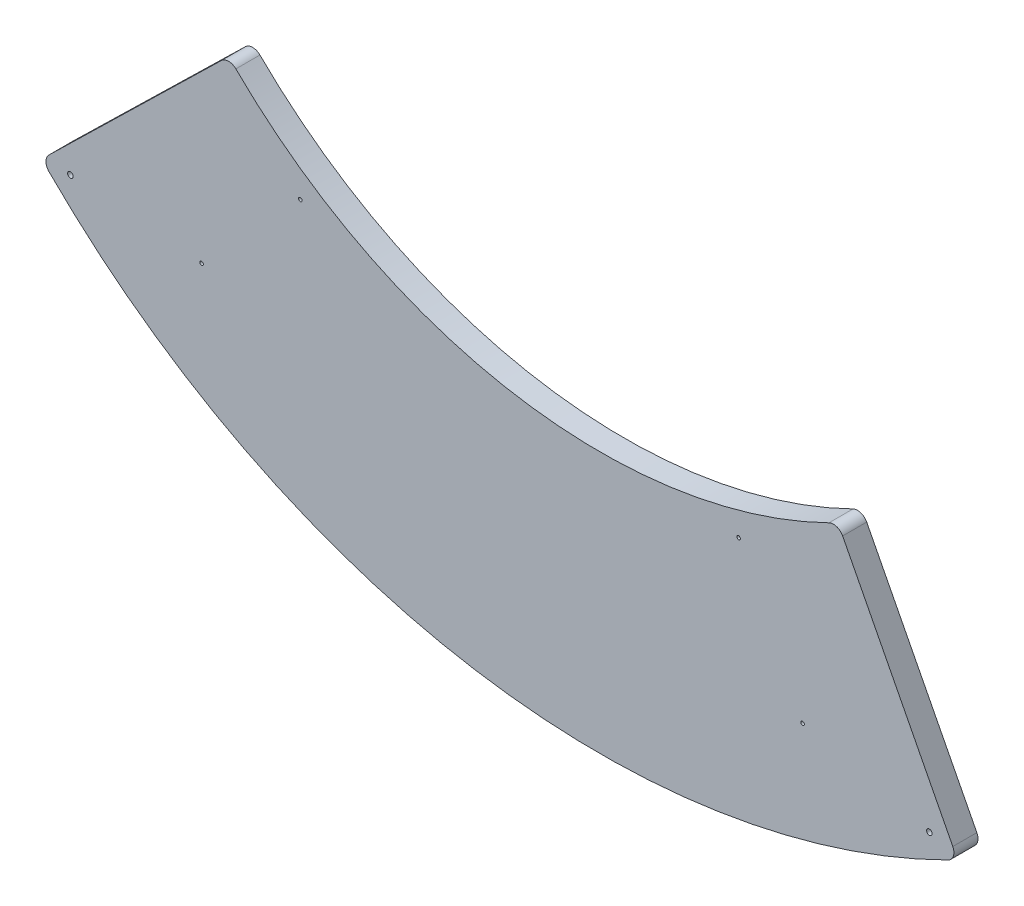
from build123d import *

# Parameters (mm, degrees)
EXTRUSION1_DEPTH        = 35
ESQUISSE4_R             = 2.6
ENL_V_MAT_EXTRU_3_DEPTH = 1377.522448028
CONG_1_R                = 15
ESQUISSE5_R             = 4
ENL_V_MAT_EXTRU_4_DEPTH = 1373.820226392


with BuildPart() as part:
    # Esquisse1 → Extrusion1 (new body)
    with BuildSketch(Plane.XY):
        with BuildLine():
            Line((-542.115261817, -500.842004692), (-814.297476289, -766.0152351))
            ThreePointArc((-814.297476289, -766.0152351), (-183.77341001, -1094.549430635), (518.402372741, -982.994574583))
            Line((518.402372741, -982.994574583), (344.394329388, -645.176278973))
            ThreePointArc((344.394329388, -645.176278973), (-122.657619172, -719.172653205), (-542.115261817, -500.842004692))
        make_face()
    extrude(amount=EXTRUSION1_DEPTH)

    # Esquisse4 → Enl_v. mat.-Extru.3 (cut, through all)
    with BuildSketch(Plane(origin=(0, 0, 0), x_dir=(-1, 0, 0), z_dir=(0, 0, -1))):
        with Locations((-199.79500938, -736.210914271)):
            Circle(ESQUISSE4_R)
        with Locations((-292.891180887, -923.606492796)):
            Circle(ESQUISSE4_R)
        with Locations((437.928955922, -629.097500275)):
            Circle(ESQUISSE4_R)
        with Locations((581.594325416, -781.229882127)):
            Circle(ESQUISSE4_R)
    extrude(amount=-ENL_V_MAT_EXTRU_3_DEPTH, mode=Mode.SUBTRACT)

    # Cong_1
    cong_1_edges = [part.edges().sort_by_distance(p)[0] for p in [
        (344.394329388, -645.176278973, 17.5),
        (518.402372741, -982.994574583, 17.5),
        (-814.297476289, -766.0152351, 17.5),
        (-542.115261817, -500.842004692, 17.5),
    ]]
    fillet(cong_1_edges, radius=CONG_1_R)

    # Esquisse5 → Enl_v. mat.-Extru.4 (cut, through all)
    with BuildSketch(Plane.XY.offset(35)):
        with Locations((-772.56491146, -765.262621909)):
            Circle(ESQUISSE5_R)
        with Locations((477.402158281, -968.553817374)):
            Circle(ESQUISSE5_R)
    extrude(amount=-ENL_V_MAT_EXTRU_4_DEPTH, mode=Mode.SUBTRACT)


solid = part.part
